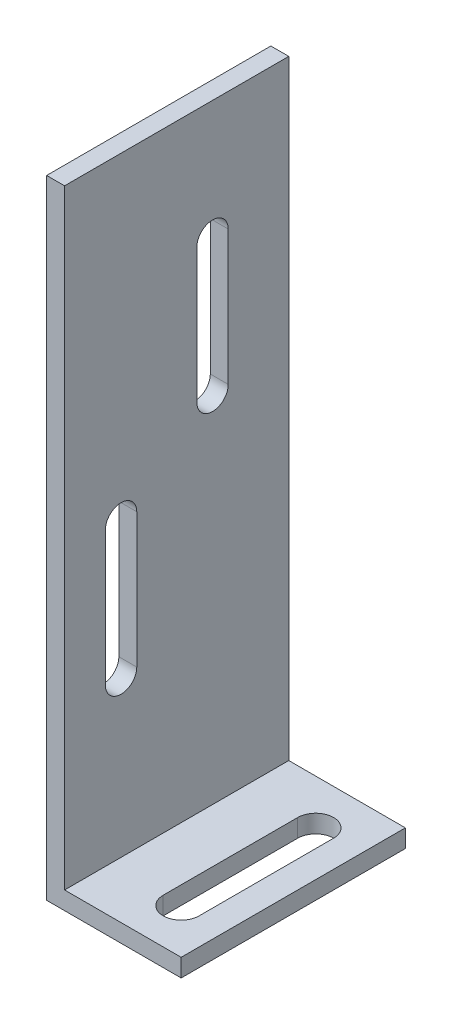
ISO-10303-21;
HEADER;
FILE_DESCRIPTION(('STEP AP214'),'2;1');
FILE_NAME('part.step','',(''),(''),'','','');
FILE_SCHEMA(('AUTOMOTIVE_DESIGN { 1 0 10303 214 1 1 1 1 }'));
ENDSEC;
DATA;
#1=APPLICATION_CONTEXT('core data for automotive mechanical design processes');
#2=APPLICATION_PROTOCOL_DEFINITION('international standard','automotive_design',2000,#1);
#3=PRODUCT_CONTEXT('',#1,'mechanical');
#4=PRODUCT('Part','Part','',(#3));
#5=PRODUCT_RELATED_PRODUCT_CATEGORY('part','',(#4));
#6=PRODUCT_DEFINITION_FORMATION('','',#4);
#7=PRODUCT_DEFINITION_CONTEXT('part definition',#1,'design');
#8=PRODUCT_DEFINITION('design','',#6,#7);
#9=PRODUCT_DEFINITION_SHAPE('','',#8);
#10=(LENGTH_UNIT() NAMED_UNIT(*) SI_UNIT(.MILLI.,.METRE.));
#11=(NAMED_UNIT(*) PLANE_ANGLE_UNIT() SI_UNIT($,.RADIAN.));
#12=(NAMED_UNIT(*) SI_UNIT($,.STERADIAN.) SOLID_ANGLE_UNIT());
#13=UNCERTAINTY_MEASURE_WITH_UNIT(LENGTH_MEASURE(1.E-05),#10,'distance_accuracy_value','');
#14=(GEOMETRIC_REPRESENTATION_CONTEXT(3) GLOBAL_UNCERTAINTY_ASSIGNED_CONTEXT((#13)) GLOBAL_UNIT_ASSIGNED_CONTEXT((#10,
#11,#12)) REPRESENTATION_CONTEXT('',''));
#15=CARTESIAN_POINT('',(0.,0.,0.));
#16=DIRECTION('',(0.,0.,1.));
#17=DIRECTION('',(1.,0.,0.));
#18=AXIS2_PLACEMENT_3D('',#15,#16,#17);
#19=CARTESIAN_POINT('',(2.00000000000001,70.,-25.));
#20=DIRECTION('',(0.,1.,0.));
#21=DIRECTION('',(0.,0.,1.));
#22=AXIS2_PLACEMENT_3D('',#19,#20,#21);
#23=PLANE('',#22);
#24=DIRECTION('',(-1.,0.,0.));
#25=VECTOR('',#24,1.);
#26=CARTESIAN_POINT('',(2.00000000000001,70.,0.));
#27=LINE('',#26,#25);
#28=CARTESIAN_POINT('',(2.00000000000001,70.,0.));
#29=VERTEX_POINT('',#28);
#30=CARTESIAN_POINT('',(0.,70.,0.));
#31=VERTEX_POINT('',#30);
#32=EDGE_CURVE('E248',#29,#31,#27,.T.);
#33=ORIENTED_EDGE('',*,*,#32,.F.);
#34=DIRECTION('',(0.,0.,1.));
#35=VECTOR('',#34,1.);
#36=CARTESIAN_POINT('',(2.00000000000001,70.,-25.));
#37=LINE('',#36,#35);
#38=CARTESIAN_POINT('',(2.00000000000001,70.,-25.));
#39=VERTEX_POINT('',#38);
#40=EDGE_CURVE('E11',#39,#29,#37,.T.);
#41=ORIENTED_EDGE('',*,*,#40,.F.);
#42=DIRECTION('',(-1.,0.,0.));
#43=VECTOR('',#42,1.);
#44=CARTESIAN_POINT('',(2.00000000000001,70.,-25.));
#45=LINE('',#44,#43);
#46=CARTESIAN_POINT('',(0.,70.,-25.));
#47=VERTEX_POINT('',#46);
#48=EDGE_CURVE('E255',#39,#47,#45,.T.);
#49=ORIENTED_EDGE('',*,*,#48,.T.);
#50=DIRECTION('',(0.,0.,1.));
#51=VECTOR('',#50,1.);
#52=CARTESIAN_POINT('',(0.,70.,-25.));
#53=LINE('',#52,#51);
#54=EDGE_CURVE('E36',#47,#31,#53,.T.);
#55=ORIENTED_EDGE('',*,*,#54,.T.);
#56=EDGE_LOOP('',(#33,#41,#49,#55));
#57=FACE_BOUND('',#56,.T.);
#58=ADVANCED_FACE('F33',(#57),#23,.T.);
#59=CARTESIAN_POINT('',(2.00000000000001,1.99999999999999,-25.));
#60=DIRECTION('',(1.,0.,0.));
#61=DIRECTION('',(0.,1.,0.));
#62=AXIS2_PLACEMENT_3D('',#59,#60,#61);
#63=PLANE('',#62);
#64=CARTESIAN_POINT('',(2.00000000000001,34.5,-6.3));
#65=DIRECTION('',(1.,0.,0.));
#66=DIRECTION('',(0.,1.,0.));
#67=AXIS2_PLACEMENT_3D('',#64,#65,#66);
#68=CIRCLE('',#67,1.75);
#69=CARTESIAN_POINT('',(2.00000000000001,34.5,-8.05));
#70=VERTEX_POINT('',#69);
#71=CARTESIAN_POINT('',(2.00000000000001,34.5,-4.55));
#72=VERTEX_POINT('',#71);
#73=EDGE_CURVE('E191',#70,#72,#68,.T.);
#74=ORIENTED_EDGE('',*,*,#73,.F.);
#75=DIRECTION('',(0.,1.,0.));
#76=VECTOR('',#75,1.);
#77=CARTESIAN_POINT('',(2.00000000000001,2.,-8.04999999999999));
#78=LINE('',#77,#76);
#79=CARTESIAN_POINT('',(2.00000000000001,19.5,-8.05));
#80=VERTEX_POINT('',#79);
#81=EDGE_CURVE('E184',#80,#70,#78,.T.);
#82=ORIENTED_EDGE('',*,*,#81,.F.);
#83=CARTESIAN_POINT('',(2.00000000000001,19.5,-6.29999999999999));
#84=DIRECTION('',(1.,0.,0.));
#85=DIRECTION('',(0.,1.,0.));
#86=AXIS2_PLACEMENT_3D('',#83,#84,#85);
#87=CIRCLE('',#86,1.75);
#88=CARTESIAN_POINT('',(2.00000000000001,19.5,-4.55));
#89=VERTEX_POINT('',#88);
#90=EDGE_CURVE('E164',#89,#80,#87,.T.);
#91=ORIENTED_EDGE('',*,*,#90,.F.);
#92=DIRECTION('',(0.,-1.,0.));
#93=VECTOR('',#92,1.);
#94=CARTESIAN_POINT('',(2.00000000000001,2.,-4.55));
#95=LINE('',#94,#93);
#96=EDGE_CURVE('E189',#72,#89,#95,.T.);
#97=ORIENTED_EDGE('',*,*,#96,.F.);
#98=EDGE_LOOP('',(#74,#82,#91,#97));
#99=FACE_BOUND('',#98,.T.);
#100=CARTESIAN_POINT('',(2.00000000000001,56.7,-16.5));
#101=DIRECTION('',(1.,0.,0.));
#102=DIRECTION('',(0.,1.,0.));
#103=AXIS2_PLACEMENT_3D('',#100,#101,#102);
#104=CIRCLE('',#103,1.75);
#105=CARTESIAN_POINT('',(2.00000000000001,56.7,-18.25));
#106=VERTEX_POINT('',#105);
#107=CARTESIAN_POINT('',(2.00000000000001,56.7,-14.75));
#108=VERTEX_POINT('',#107);
#109=EDGE_CURVE('E220',#106,#108,#104,.T.);
#110=ORIENTED_EDGE('',*,*,#109,.F.);
#111=DIRECTION('',(0.,1.,0.));
#112=VECTOR('',#111,1.);
#113=CARTESIAN_POINT('',(2.00000000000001,2.,-18.25));
#114=LINE('',#113,#112);
#115=CARTESIAN_POINT('',(2.00000000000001,41.7,-18.25));
#116=VERTEX_POINT('',#115);
#117=EDGE_CURVE('E207',#116,#106,#114,.T.);
#118=ORIENTED_EDGE('',*,*,#117,.F.);
#119=CARTESIAN_POINT('',(2.00000000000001,41.7,-16.5));
#120=DIRECTION('',(1.,0.,0.));
#121=DIRECTION('',(0.,1.,0.));
#122=AXIS2_PLACEMENT_3D('',#119,#120,#121);
#123=CIRCLE('',#122,1.75);
#124=CARTESIAN_POINT('',(2.00000000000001,41.7,-14.75));
#125=VERTEX_POINT('',#124);
#126=EDGE_CURVE('E215',#125,#116,#123,.T.);
#127=ORIENTED_EDGE('',*,*,#126,.F.);
#128=DIRECTION('',(0.,-1.,0.));
#129=VECTOR('',#128,1.);
#130=CARTESIAN_POINT('',(2.00000000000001,2.,-14.75));
#131=LINE('',#130,#129);
#132=EDGE_CURVE('E218',#108,#125,#131,.T.);
#133=ORIENTED_EDGE('',*,*,#132,.F.);
#134=EDGE_LOOP('',(#110,#118,#127,#133));
#135=FACE_BOUND('',#134,.T.);
#136=DIRECTION('',(0.,1.,0.));
#137=VECTOR('',#136,1.);
#138=CARTESIAN_POINT('',(2.00000000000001,1.99999999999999,0.));
#139=LINE('',#138,#137);
#140=CARTESIAN_POINT('',(2.00000000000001,1.99999999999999,0.));
#141=VERTEX_POINT('',#140);
#142=EDGE_CURVE('E259',#141,#29,#139,.T.);
#143=ORIENTED_EDGE('',*,*,#142,.F.);
#144=DIRECTION('',(0.,0.,1.));
#145=VECTOR('',#144,1.);
#146=CARTESIAN_POINT('',(2.00000000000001,1.99999999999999,-25.));
#147=LINE('',#146,#145);
#148=CARTESIAN_POINT('',(2.00000000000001,1.99999999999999,-25.));
#149=VERTEX_POINT('',#148);
#150=EDGE_CURVE('E41',#149,#141,#147,.T.);
#151=ORIENTED_EDGE('',*,*,#150,.F.);
#152=DIRECTION('',(0.,1.,0.));
#153=VECTOR('',#152,1.);
#154=CARTESIAN_POINT('',(2.00000000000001,1.99999999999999,-25.));
#155=LINE('',#154,#153);
#156=EDGE_CURVE('E271',#149,#39,#155,.T.);
#157=ORIENTED_EDGE('',*,*,#156,.T.);
#158=ORIENTED_EDGE('',*,*,#40,.T.);
#159=EDGE_LOOP('',(#143,#151,#157,#158));
#160=FACE_BOUND('',#159,.T.);
#161=ADVANCED_FACE('F307',(#99,#135,#160),#63,.T.);
#162=CARTESIAN_POINT('',(15.,2.,-25.));
#163=DIRECTION('',(0.,1.,0.));
#164=DIRECTION('',(-1.,0.,0.));
#165=AXIS2_PLACEMENT_3D('',#162,#163,#164);
#166=PLANE('',#165);
#167=CARTESIAN_POINT('',(10.,1.99999999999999,-20.));
#168=DIRECTION('',(0.,1.,0.));
#169=DIRECTION('',(-1.,0.,0.));
#170=AXIS2_PLACEMENT_3D('',#167,#168,#169);
#171=CIRCLE('',#170,2.);
#172=CARTESIAN_POINT('',(12.,1.99999999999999,-20.));
#173=VERTEX_POINT('',#172);
#174=CARTESIAN_POINT('',(8.,2.,-20.));
#175=VERTEX_POINT('',#174);
#176=EDGE_CURVE('E222',#173,#175,#171,.T.);
#177=ORIENTED_EDGE('',*,*,#176,.F.);
#178=DIRECTION('',(0.,0.,-1.));
#179=VECTOR('',#178,1.);
#180=CARTESIAN_POINT('',(12.,1.99999999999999,-20.));
#181=LINE('',#180,#179);
#182=CARTESIAN_POINT('',(12.,1.99999999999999,-5.));
#183=VERTEX_POINT('',#182);
#184=EDGE_CURVE('E227',#183,#173,#181,.T.);
#185=ORIENTED_EDGE('',*,*,#184,.F.);
#186=CARTESIAN_POINT('',(10.,1.99999999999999,-5.));
#187=DIRECTION('',(0.,1.,0.));
#188=DIRECTION('',(-1.,0.,0.));
#189=AXIS2_PLACEMENT_3D('',#186,#187,#188);
#190=CIRCLE('',#189,2.);
#191=CARTESIAN_POINT('',(8.,1.99999999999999,-5.));
#192=VERTEX_POINT('',#191);
#193=EDGE_CURVE('E241',#192,#183,#190,.T.);
#194=ORIENTED_EDGE('',*,*,#193,.F.);
#195=DIRECTION('',(0.,0.,1.));
#196=VECTOR('',#195,1.);
#197=CARTESIAN_POINT('',(8.,1.99999999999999,-20.));
#198=LINE('',#197,#196);
#199=EDGE_CURVE('E238',#175,#192,#198,.T.);
#200=ORIENTED_EDGE('',*,*,#199,.F.);
#201=EDGE_LOOP('',(#177,#185,#194,#200));
#202=FACE_BOUND('',#201,.T.);
#203=DIRECTION('',(-1.,0.,0.));
#204=VECTOR('',#203,1.);
#205=CARTESIAN_POINT('',(15.,2.,0.));
#206=LINE('',#205,#204);
#207=CARTESIAN_POINT('',(15.,2.,0.));
#208=VERTEX_POINT('',#207);
#209=EDGE_CURVE('E285',#208,#141,#206,.T.);
#210=ORIENTED_EDGE('',*,*,#209,.F.);
#211=DIRECTION('',(0.,0.,1.));
#212=VECTOR('',#211,1.);
#213=CARTESIAN_POINT('',(15.,2.,-25.));
#214=LINE('',#213,#212);
#215=CARTESIAN_POINT('',(15.,2.,-25.));
#216=VERTEX_POINT('',#215);
#217=EDGE_CURVE('E291',#216,#208,#214,.T.);
#218=ORIENTED_EDGE('',*,*,#217,.F.);
#219=DIRECTION('',(-1.,0.,0.));
#220=VECTOR('',#219,1.);
#221=CARTESIAN_POINT('',(15.,2.,-25.));
#222=LINE('',#221,#220);
#223=EDGE_CURVE('E268',#216,#149,#222,.T.);
#224=ORIENTED_EDGE('',*,*,#223,.T.);
#225=ORIENTED_EDGE('',*,*,#150,.T.);
#226=EDGE_LOOP('',(#210,#218,#224,#225));
#227=FACE_BOUND('',#226,.T.);
#228=ADVANCED_FACE('F320',(#202,#227),#166,.T.);
#229=CARTESIAN_POINT('',(15.,0.,-25.));
#230=DIRECTION('',(1.,0.,0.));
#231=DIRECTION('',(0.,0.,-1.));
#232=AXIS2_PLACEMENT_3D('',#229,#230,#231);
#233=PLANE('',#232);
#234=DIRECTION('',(0.,1.,0.));
#235=VECTOR('',#234,1.);
#236=CARTESIAN_POINT('',(15.,0.,0.));
#237=LINE('',#236,#235);
#238=CARTESIAN_POINT('',(15.,0.,0.));
#239=VERTEX_POINT('',#238);
#240=EDGE_CURVE('E282',#239,#208,#237,.T.);
#241=ORIENTED_EDGE('',*,*,#240,.F.);
#242=DIRECTION('',(0.,0.,1.));
#243=VECTOR('',#242,1.);
#244=CARTESIAN_POINT('',(15.,0.,-25.));
#245=LINE('',#244,#243);
#246=CARTESIAN_POINT('',(15.,0.,-25.));
#247=VERTEX_POINT('',#246);
#248=EDGE_CURVE('E293',#247,#239,#245,.T.);
#249=ORIENTED_EDGE('',*,*,#248,.F.);
#250=DIRECTION('',(0.,1.,0.));
#251=VECTOR('',#250,1.);
#252=CARTESIAN_POINT('',(15.,0.,-25.));
#253=LINE('',#252,#251);
#254=EDGE_CURVE('E265',#247,#216,#253,.T.);
#255=ORIENTED_EDGE('',*,*,#254,.T.);
#256=ORIENTED_EDGE('',*,*,#217,.T.);
#257=EDGE_LOOP('',(#241,#249,#255,#256));
#258=FACE_BOUND('',#257,.T.);
#259=ADVANCED_FACE('F318',(#258),#233,.T.);
#260=CARTESIAN_POINT('',(0.,0.,-25.));
#261=DIRECTION('',(0.,-1.,0.));
#262=DIRECTION('',(0.,0.,-1.));
#263=AXIS2_PLACEMENT_3D('',#260,#261,#262);
#264=PLANE('',#263);
#265=CARTESIAN_POINT('',(10.,0.,-20.));
#266=DIRECTION('',(0.,1.,0.));
#267=DIRECTION('',(-1.,0.,0.));
#268=AXIS2_PLACEMENT_3D('',#265,#266,#267);
#269=CIRCLE('',#268,2.);
#270=CARTESIAN_POINT('',(12.,0.,-20.));
#271=VERTEX_POINT('',#270);
#272=CARTESIAN_POINT('',(8.,0.,-20.));
#273=VERTEX_POINT('',#272);
#274=EDGE_CURVE('E223',#271,#273,#269,.T.);
#275=ORIENTED_EDGE('',*,*,#274,.T.);
#276=DIRECTION('',(0.,0.,1.));
#277=VECTOR('',#276,1.);
#278=CARTESIAN_POINT('',(8.,0.,-20.));
#279=LINE('',#278,#277);
#280=CARTESIAN_POINT('',(8.,0.,-5.));
#281=VERTEX_POINT('',#280);
#282=EDGE_CURVE('E226',#273,#281,#279,.T.);
#283=ORIENTED_EDGE('',*,*,#282,.T.);
#284=CARTESIAN_POINT('',(10.,0.,-5.));
#285=DIRECTION('',(0.,1.,0.));
#286=DIRECTION('',(-1.,0.,0.));
#287=AXIS2_PLACEMENT_3D('',#284,#285,#286);
#288=CIRCLE('',#287,2.);
#289=CARTESIAN_POINT('',(12.,0.,-5.));
#290=VERTEX_POINT('',#289);
#291=EDGE_CURVE('E230',#281,#290,#288,.T.);
#292=ORIENTED_EDGE('',*,*,#291,.T.);
#293=DIRECTION('',(0.,0.,-1.));
#294=VECTOR('',#293,1.);
#295=CARTESIAN_POINT('',(12.,0.,-20.));
#296=LINE('',#295,#294);
#297=EDGE_CURVE('E233',#290,#271,#296,.T.);
#298=ORIENTED_EDGE('',*,*,#297,.T.);
#299=EDGE_LOOP('',(#275,#283,#292,#298));
#300=FACE_BOUND('',#299,.T.);
#301=DIRECTION('',(1.,0.,0.));
#302=VECTOR('',#301,1.);
#303=CARTESIAN_POINT('',(0.,0.,0.));
#304=LINE('',#303,#302);
#305=CARTESIAN_POINT('',(0.,0.,0.));
#306=VERTEX_POINT('',#305);
#307=EDGE_CURVE('E279',#306,#239,#304,.T.);
#308=ORIENTED_EDGE('',*,*,#307,.F.);
#309=DIRECTION('',(0.,0.,1.));
#310=VECTOR('',#309,1.);
#311=CARTESIAN_POINT('',(0.,0.,-25.));
#312=LINE('',#311,#310);
#313=CARTESIAN_POINT('',(0.,0.,-25.));
#314=VERTEX_POINT('',#313);
#315=EDGE_CURVE('E294',#314,#306,#312,.T.);
#316=ORIENTED_EDGE('',*,*,#315,.F.);
#317=DIRECTION('',(1.,0.,0.));
#318=VECTOR('',#317,1.);
#319=CARTESIAN_POINT('',(0.,0.,-25.));
#320=LINE('',#319,#318);
#321=EDGE_CURVE('E262',#314,#247,#320,.T.);
#322=ORIENTED_EDGE('',*,*,#321,.T.);
#323=ORIENTED_EDGE('',*,*,#248,.T.);
#324=EDGE_LOOP('',(#308,#316,#322,#323));
#325=FACE_BOUND('',#324,.T.);
#326=ADVANCED_FACE('F315',(#300,#325),#264,.T.);
#327=CARTESIAN_POINT('',(0.,70.,-25.));
#328=DIRECTION('',(-1.,0.,0.));
#329=DIRECTION('',(0.,0.,1.));
#330=AXIS2_PLACEMENT_3D('',#327,#328,#329);
#331=PLANE('',#330);
#332=CARTESIAN_POINT('',(0.,34.5,-6.3));
#333=DIRECTION('',(-1.,0.,0.));
#334=DIRECTION('',(0.,0.,1.));
#335=AXIS2_PLACEMENT_3D('',#332,#333,#334);
#336=CIRCLE('',#335,1.75);
#337=CARTESIAN_POINT('',(0.,34.5,-4.55));
#338=VERTEX_POINT('',#337);
#339=CARTESIAN_POINT('',(0.,34.5,-8.05));
#340=VERTEX_POINT('',#339);
#341=EDGE_CURVE('E57',#338,#340,#336,.T.);
#342=ORIENTED_EDGE('',*,*,#341,.F.);
#343=DIRECTION('',(0.,1.,0.));
#344=VECTOR('',#343,1.);
#345=CARTESIAN_POINT('',(0.,34.5,-4.55));
#346=LINE('',#345,#344);
#347=CARTESIAN_POINT('',(0.,19.5,-4.55));
#348=VERTEX_POINT('',#347);
#349=EDGE_CURVE('E177',#348,#338,#346,.T.);
#350=ORIENTED_EDGE('',*,*,#349,.F.);
#351=CARTESIAN_POINT('',(0.,19.5,-6.29999999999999));
#352=DIRECTION('',(-1.,0.,0.));
#353=DIRECTION('',(0.,0.,1.));
#354=AXIS2_PLACEMENT_3D('',#351,#352,#353);
#355=CIRCLE('',#354,1.75);
#356=CARTESIAN_POINT('',(0.,19.5,-8.05));
#357=VERTEX_POINT('',#356);
#358=EDGE_CURVE('E161',#357,#348,#355,.T.);
#359=ORIENTED_EDGE('',*,*,#358,.F.);
#360=DIRECTION('',(0.,-1.,0.));
#361=VECTOR('',#360,1.);
#362=CARTESIAN_POINT('',(0.,34.5,-8.05));
#363=LINE('',#362,#361);
#364=EDGE_CURVE('E170',#340,#357,#363,.T.);
#365=ORIENTED_EDGE('',*,*,#364,.F.);
#366=EDGE_LOOP('',(#342,#350,#359,#365));
#367=FACE_BOUND('',#366,.T.);
#368=CARTESIAN_POINT('',(0.,56.7,-16.5));
#369=DIRECTION('',(-1.,0.,0.));
#370=DIRECTION('',(0.,0.,-1.));
#371=AXIS2_PLACEMENT_3D('',#368,#369,#370);
#372=CIRCLE('',#371,1.75);
#373=CARTESIAN_POINT('',(0.,56.7,-14.75));
#374=VERTEX_POINT('',#373);
#375=CARTESIAN_POINT('',(0.,56.7,-18.25));
#376=VERTEX_POINT('',#375);
#377=EDGE_CURVE('E193',#374,#376,#372,.T.);
#378=ORIENTED_EDGE('',*,*,#377,.F.);
#379=DIRECTION('',(0.,1.,0.));
#380=VECTOR('',#379,1.);
#381=CARTESIAN_POINT('',(0.,56.7,-14.75));
#382=LINE('',#381,#380);
#383=CARTESIAN_POINT('',(0.,41.7,-14.75));
#384=VERTEX_POINT('',#383);
#385=EDGE_CURVE('E201',#384,#374,#382,.T.);
#386=ORIENTED_EDGE('',*,*,#385,.F.);
#387=CARTESIAN_POINT('',(0.,41.7,-16.5));
#388=DIRECTION('',(-1.,0.,0.));
#389=DIRECTION('',(0.,0.,-1.));
#390=AXIS2_PLACEMENT_3D('',#387,#388,#389);
#391=CIRCLE('',#390,1.75);
#392=CARTESIAN_POINT('',(0.,41.7,-18.25));
#393=VERTEX_POINT('',#392);
#394=EDGE_CURVE('E198',#393,#384,#391,.T.);
#395=ORIENTED_EDGE('',*,*,#394,.F.);
#396=DIRECTION('',(0.,-1.,0.));
#397=VECTOR('',#396,1.);
#398=CARTESIAN_POINT('',(0.,56.7,-18.25));
#399=LINE('',#398,#397);
#400=EDGE_CURVE('E195',#376,#393,#399,.T.);
#401=ORIENTED_EDGE('',*,*,#400,.F.);
#402=EDGE_LOOP('',(#378,#386,#395,#401));
#403=FACE_BOUND('',#402,.T.);
#404=DIRECTION('',(0.,-1.,0.));
#405=VECTOR('',#404,1.);
#406=CARTESIAN_POINT('',(0.,70.,0.));
#407=LINE('',#406,#405);
#408=EDGE_CURVE('E276',#31,#306,#407,.T.);
#409=ORIENTED_EDGE('',*,*,#408,.F.);
#410=ORIENTED_EDGE('',*,*,#54,.F.);
#411=DIRECTION('',(0.,-1.,0.));
#412=VECTOR('',#411,1.);
#413=CARTESIAN_POINT('',(0.,70.,-25.));
#414=LINE('',#413,#412);
#415=EDGE_CURVE('E258',#47,#314,#414,.T.);
#416=ORIENTED_EDGE('',*,*,#415,.T.);
#417=ORIENTED_EDGE('',*,*,#315,.T.);
#418=EDGE_LOOP('',(#409,#410,#416,#417));
#419=FACE_BOUND('',#418,.T.);
#420=ADVANCED_FACE('F174',(#367,#403,#419),#331,.T.);
#421=CARTESIAN_POINT('',(0.,0.,-25.));
#422=DIRECTION('',(0.,0.,1.));
#423=DIRECTION('',(1.,0.,0.));
#424=AXIS2_PLACEMENT_3D('',#421,#422,#423);
#425=PLANE('',#424);
#426=ORIENTED_EDGE('',*,*,#48,.F.);
#427=ORIENTED_EDGE('',*,*,#156,.F.);
#428=ORIENTED_EDGE('',*,*,#223,.F.);
#429=ORIENTED_EDGE('',*,*,#254,.F.);
#430=ORIENTED_EDGE('',*,*,#321,.F.);
#431=ORIENTED_EDGE('',*,*,#415,.F.);
#432=EDGE_LOOP('',(#426,#427,#428,#429,#430,#431));
#433=FACE_BOUND('',#432,.T.);
#434=ADVANCED_FACE('F310',(#433),#425,.F.);
#435=CARTESIAN_POINT('',(0.,0.,0.));
#436=DIRECTION('',(0.,0.,1.));
#437=DIRECTION('',(1.,0.,0.));
#438=AXIS2_PLACEMENT_3D('',#435,#436,#437);
#439=PLANE('',#438);
#440=ORIENTED_EDGE('',*,*,#32,.T.);
#441=ORIENTED_EDGE('',*,*,#408,.T.);
#442=ORIENTED_EDGE('',*,*,#307,.T.);
#443=ORIENTED_EDGE('',*,*,#240,.T.);
#444=ORIENTED_EDGE('',*,*,#209,.T.);
#445=ORIENTED_EDGE('',*,*,#142,.T.);
#446=EDGE_LOOP('',(#440,#441,#442,#443,#444,#445));
#447=FACE_BOUND('',#446,.T.);
#448=ADVANCED_FACE('F303',(#447),#439,.T.);
#449=CARTESIAN_POINT('',(10.,0.,-20.));
#450=DIRECTION('',(0.,1.,0.));
#451=DIRECTION('',(-1.,0.,0.));
#452=AXIS2_PLACEMENT_3D('',#449,#450,#451);
#453=CYLINDRICAL_SURFACE('',#452,2.);
#454=ORIENTED_EDGE('',*,*,#176,.T.);
#455=DIRECTION('',(0.,1.,0.));
#456=VECTOR('',#455,1.);
#457=CARTESIAN_POINT('',(8.,0.,-20.));
#458=LINE('',#457,#456);
#459=EDGE_CURVE('E236',#273,#175,#458,.T.);
#460=ORIENTED_EDGE('',*,*,#459,.F.);
#461=ORIENTED_EDGE('',*,*,#274,.F.);
#462=DIRECTION('',(0.,1.,0.));
#463=VECTOR('',#462,1.);
#464=CARTESIAN_POINT('',(12.,0.,-20.));
#465=LINE('',#464,#463);
#466=EDGE_CURVE('E246',#271,#173,#465,.T.);
#467=ORIENTED_EDGE('',*,*,#466,.T.);
#468=EDGE_LOOP('',(#454,#460,#461,#467));
#469=FACE_BOUND('',#468,.T.);
#470=ADVANCED_FACE('F442',(#469),#453,.F.);
#471=CARTESIAN_POINT('',(12.,0.,-20.));
#472=DIRECTION('',(1.,0.,0.));
#473=DIRECTION('',(0.,0.,-1.));
#474=AXIS2_PLACEMENT_3D('',#471,#472,#473);
#475=PLANE('',#474);
#476=ORIENTED_EDGE('',*,*,#184,.T.);
#477=ORIENTED_EDGE('',*,*,#466,.F.);
#478=ORIENTED_EDGE('',*,*,#297,.F.);
#479=DIRECTION('',(0.,1.,0.));
#480=VECTOR('',#479,1.);
#481=CARTESIAN_POINT('',(12.,0.,-5.));
#482=LINE('',#481,#480);
#483=EDGE_CURVE('E249',#290,#183,#482,.T.);
#484=ORIENTED_EDGE('',*,*,#483,.T.);
#485=EDGE_LOOP('',(#476,#477,#478,#484));
#486=FACE_BOUND('',#485,.T.);
#487=ADVANCED_FACE('F438',(#486),#475,.F.);
#488=CARTESIAN_POINT('',(10.,0.,-5.));
#489=DIRECTION('',(0.,1.,0.));
#490=DIRECTION('',(-1.,0.,0.));
#491=AXIS2_PLACEMENT_3D('',#488,#489,#490);
#492=CYLINDRICAL_SURFACE('',#491,2.);
#493=ORIENTED_EDGE('',*,*,#193,.T.);
#494=ORIENTED_EDGE('',*,*,#483,.F.);
#495=ORIENTED_EDGE('',*,*,#291,.F.);
#496=DIRECTION('',(0.,1.,0.));
#497=VECTOR('',#496,1.);
#498=CARTESIAN_POINT('',(8.,0.,-5.));
#499=LINE('',#498,#497);
#500=EDGE_CURVE('E251',#281,#192,#499,.T.);
#501=ORIENTED_EDGE('',*,*,#500,.T.);
#502=EDGE_LOOP('',(#493,#494,#495,#501));
#503=FACE_BOUND('',#502,.T.);
#504=ADVANCED_FACE('F441',(#503),#492,.F.);
#505=CARTESIAN_POINT('',(8.,0.,-20.));
#506=DIRECTION('',(-1.,0.,0.));
#507=DIRECTION('',(0.,-1.,0.));
#508=AXIS2_PLACEMENT_3D('',#505,#506,#507);
#509=PLANE('',#508);
#510=ORIENTED_EDGE('',*,*,#199,.T.);
#511=ORIENTED_EDGE('',*,*,#500,.F.);
#512=ORIENTED_EDGE('',*,*,#282,.F.);
#513=ORIENTED_EDGE('',*,*,#459,.T.);
#514=EDGE_LOOP('',(#510,#511,#512,#513));
#515=FACE_BOUND('',#514,.T.);
#516=ADVANCED_FACE('F347',(#515),#509,.F.);
#517=CARTESIAN_POINT('',(15.,56.7,-16.5));
#518=DIRECTION('',(-1.,0.,0.));
#519=DIRECTION('',(0.,0.,1.));
#520=AXIS2_PLACEMENT_3D('',#517,#518,#519);
#521=CYLINDRICAL_SURFACE('',#520,1.75);
#522=ORIENTED_EDGE('',*,*,#109,.T.);
#523=DIRECTION('',(-1.,0.,0.));
#524=VECTOR('',#523,1.);
#525=CARTESIAN_POINT('',(15.,56.7,-14.75));
#526=LINE('',#525,#524);
#527=EDGE_CURVE('E205',#108,#374,#526,.T.);
#528=ORIENTED_EDGE('',*,*,#527,.T.);
#529=ORIENTED_EDGE('',*,*,#377,.T.);
#530=DIRECTION('',(-1.,0.,0.));
#531=VECTOR('',#530,1.);
#532=CARTESIAN_POINT('',(15.,56.7,-18.25));
#533=LINE('',#532,#531);
#534=EDGE_CURVE('E204',#106,#376,#533,.T.);
#535=ORIENTED_EDGE('',*,*,#534,.F.);
#536=EDGE_LOOP('',(#522,#528,#529,#535));
#537=FACE_BOUND('',#536,.T.);
#538=ADVANCED_FACE('F363',(#537),#521,.F.);
#539=CARTESIAN_POINT('',(15.,56.7,-14.75));
#540=DIRECTION('',(0.,0.,1.));
#541=DIRECTION('',(0.,-1.,0.));
#542=AXIS2_PLACEMENT_3D('',#539,#540,#541);
#543=PLANE('',#542);
#544=ORIENTED_EDGE('',*,*,#132,.T.);
#545=DIRECTION('',(-1.,0.,0.));
#546=VECTOR('',#545,1.);
#547=CARTESIAN_POINT('',(15.,41.7,-14.75));
#548=LINE('',#547,#546);
#549=EDGE_CURVE('E208',#125,#384,#548,.T.);
#550=ORIENTED_EDGE('',*,*,#549,.T.);
#551=ORIENTED_EDGE('',*,*,#385,.T.);
#552=ORIENTED_EDGE('',*,*,#527,.F.);
#553=EDGE_LOOP('',(#544,#550,#551,#552));
#554=FACE_BOUND('',#553,.T.);
#555=ADVANCED_FACE('F368',(#554),#543,.F.);
#556=CARTESIAN_POINT('',(15.,41.7,-16.5));
#557=DIRECTION('',(-1.,0.,0.));
#558=DIRECTION('',(0.,0.,1.));
#559=AXIS2_PLACEMENT_3D('',#556,#557,#558);
#560=CYLINDRICAL_SURFACE('',#559,1.75);
#561=ORIENTED_EDGE('',*,*,#126,.T.);
#562=DIRECTION('',(-1.,0.,0.));
#563=VECTOR('',#562,1.);
#564=CARTESIAN_POINT('',(15.,41.7,-18.25));
#565=LINE('',#564,#563);
#566=EDGE_CURVE('E210',#116,#393,#565,.T.);
#567=ORIENTED_EDGE('',*,*,#566,.T.);
#568=ORIENTED_EDGE('',*,*,#394,.T.);
#569=ORIENTED_EDGE('',*,*,#549,.F.);
#570=EDGE_LOOP('',(#561,#567,#568,#569));
#571=FACE_BOUND('',#570,.T.);
#572=ADVANCED_FACE('F378',(#571),#560,.F.);
#573=CARTESIAN_POINT('',(15.,56.7,-18.25));
#574=DIRECTION('',(0.,0.,-1.));
#575=DIRECTION('',(0.,1.,0.));
#576=AXIS2_PLACEMENT_3D('',#573,#574,#575);
#577=PLANE('',#576);
#578=ORIENTED_EDGE('',*,*,#117,.T.);
#579=ORIENTED_EDGE('',*,*,#534,.T.);
#580=ORIENTED_EDGE('',*,*,#400,.T.);
#581=ORIENTED_EDGE('',*,*,#566,.F.);
#582=EDGE_LOOP('',(#578,#579,#580,#581));
#583=FACE_BOUND('',#582,.T.);
#584=ADVANCED_FACE('F388',(#583),#577,.F.);
#585=CARTESIAN_POINT('',(15.,34.5,-6.3));
#586=DIRECTION('',(-1.,0.,0.));
#587=DIRECTION('',(0.,0.,1.));
#588=AXIS2_PLACEMENT_3D('',#585,#586,#587);
#589=CYLINDRICAL_SURFACE('',#588,1.75);
#590=ORIENTED_EDGE('',*,*,#73,.T.);
#591=DIRECTION('',(-1.,0.,0.));
#592=VECTOR('',#591,1.);
#593=CARTESIAN_POINT('',(15.,34.5,-4.55));
#594=LINE('',#593,#592);
#595=EDGE_CURVE('E182',#72,#338,#594,.T.);
#596=ORIENTED_EDGE('',*,*,#595,.T.);
#597=ORIENTED_EDGE('',*,*,#341,.T.);
#598=DIRECTION('',(-1.,0.,0.));
#599=VECTOR('',#598,1.);
#600=CARTESIAN_POINT('',(15.,34.5,-8.05));
#601=LINE('',#600,#599);
#602=EDGE_CURVE('E167',#70,#340,#601,.T.);
#603=ORIENTED_EDGE('',*,*,#602,.F.);
#604=EDGE_LOOP('',(#590,#596,#597,#603));
#605=FACE_BOUND('',#604,.T.);
#606=ADVANCED_FACE('F398',(#605),#589,.F.);
#607=CARTESIAN_POINT('',(15.,34.5,-4.55));
#608=DIRECTION('',(0.,0.,1.));
#609=DIRECTION('',(0.,-1.,0.));
#610=AXIS2_PLACEMENT_3D('',#607,#608,#609);
#611=PLANE('',#610);
#612=ORIENTED_EDGE('',*,*,#96,.T.);
#613=DIRECTION('',(-1.,0.,0.));
#614=VECTOR('',#613,1.);
#615=CARTESIAN_POINT('',(15.,19.5,-4.55));
#616=LINE('',#615,#614);
#617=EDGE_CURVE('E166',#89,#348,#616,.T.);
#618=ORIENTED_EDGE('',*,*,#617,.T.);
#619=ORIENTED_EDGE('',*,*,#349,.T.);
#620=ORIENTED_EDGE('',*,*,#595,.F.);
#621=EDGE_LOOP('',(#612,#618,#619,#620));
#622=FACE_BOUND('',#621,.T.);
#623=ADVANCED_FACE('F408',(#622),#611,.F.);
#624=CARTESIAN_POINT('',(15.,19.5,-6.29999999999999));
#625=DIRECTION('',(-1.,0.,0.));
#626=DIRECTION('',(0.,0.,1.));
#627=AXIS2_PLACEMENT_3D('',#624,#625,#626);
#628=CYLINDRICAL_SURFACE('',#627,1.75);
#629=ORIENTED_EDGE('',*,*,#90,.T.);
#630=DIRECTION('',(-1.,0.,0.));
#631=VECTOR('',#630,1.);
#632=CARTESIAN_POINT('',(15.,19.5,-8.05));
#633=LINE('',#632,#631);
#634=EDGE_CURVE('E49',#80,#357,#633,.T.);
#635=ORIENTED_EDGE('',*,*,#634,.T.);
#636=ORIENTED_EDGE('',*,*,#358,.T.);
#637=ORIENTED_EDGE('',*,*,#617,.F.);
#638=EDGE_LOOP('',(#629,#635,#636,#637));
#639=FACE_BOUND('',#638,.T.);
#640=ADVANCED_FACE('F158',(#639),#628,.F.);
#641=CARTESIAN_POINT('',(15.,34.5,-8.05));
#642=DIRECTION('',(0.,0.,-1.));
#643=DIRECTION('',(0.,1.,0.));
#644=AXIS2_PLACEMENT_3D('',#641,#642,#643);
#645=PLANE('',#644);
#646=ORIENTED_EDGE('',*,*,#81,.T.);
#647=ORIENTED_EDGE('',*,*,#602,.T.);
#648=ORIENTED_EDGE('',*,*,#364,.T.);
#649=ORIENTED_EDGE('',*,*,#634,.F.);
#650=EDGE_LOOP('',(#646,#647,#648,#649));
#651=FACE_BOUND('',#650,.T.);
#652=ADVANCED_FACE('F171',(#651),#645,.F.);
#653=CLOSED_SHELL('',(#58,#161,#228,#259,#326,#420,#434,#448,#470,#487,#504,#516,#538,#555,#572,
#584,#606,#623,#640,#652));
#654=MANIFOLD_SOLID_BREP('B2',#653);
#655=ADVANCED_BREP_SHAPE_REPRESENTATION('',(#18,#654),#14);
#656=SHAPE_DEFINITION_REPRESENTATION(#9,#655);
ENDSEC;
END-ISO-10303-21;
